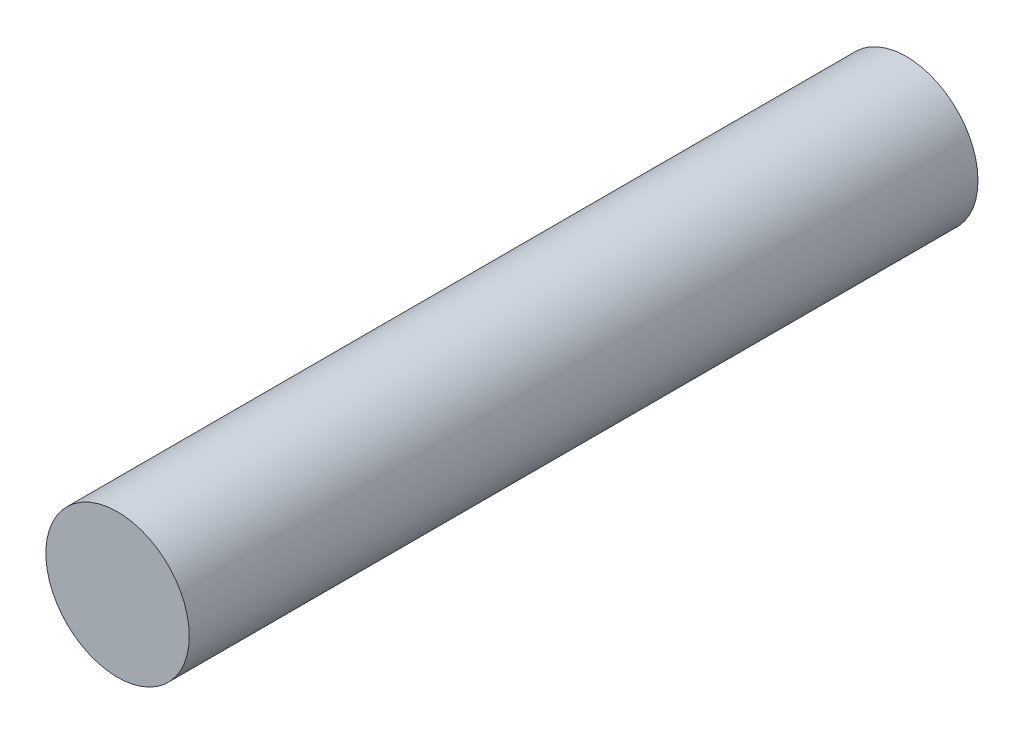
from build123d import *

# Parameters (mm, degrees)
SKETCH1_R           = 1.5
BOSS_EXTRUDE1_DEPTH = 16.5


with BuildPart() as part:
    # Sketch1 → Boss-Extrude1 (new body)
    with BuildSketch(Plane.XY):
        Circle(SKETCH1_R)
    extrude(amount=BOSS_EXTRUDE1_DEPTH)


solid = part.part
